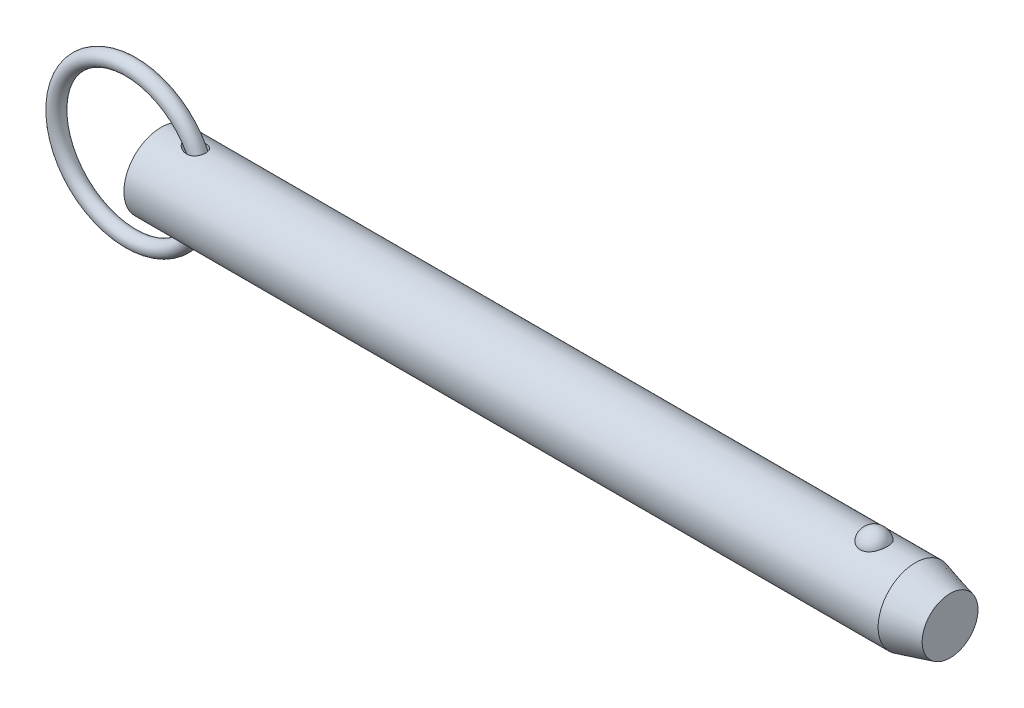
ISO-10303-21;
HEADER;
FILE_DESCRIPTION(('STEP AP214'),'2;1');
FILE_NAME('part.step','',(''),(''),'','','');
FILE_SCHEMA(('AUTOMOTIVE_DESIGN { 1 0 10303 214 1 1 1 1 }'));
ENDSEC;
DATA;
#1=APPLICATION_CONTEXT('core data for automotive mechanical design processes');
#2=APPLICATION_PROTOCOL_DEFINITION('international standard','automotive_design',2000,#1);
#3=PRODUCT_CONTEXT('',#1,'mechanical');
#4=PRODUCT('Part','Part','',(#3));
#5=PRODUCT_RELATED_PRODUCT_CATEGORY('part','',(#4));
#6=PRODUCT_DEFINITION_FORMATION('','',#4);
#7=PRODUCT_DEFINITION_CONTEXT('part definition',#1,'design');
#8=PRODUCT_DEFINITION('design','',#6,#7);
#9=PRODUCT_DEFINITION_SHAPE('','',#8);
#10=(LENGTH_UNIT() NAMED_UNIT(*) SI_UNIT(.MILLI.,.METRE.));
#11=(NAMED_UNIT(*) PLANE_ANGLE_UNIT() SI_UNIT($,.RADIAN.));
#12=(NAMED_UNIT(*) SI_UNIT($,.STERADIAN.) SOLID_ANGLE_UNIT());
#13=UNCERTAINTY_MEASURE_WITH_UNIT(LENGTH_MEASURE(1.E-05),#10,'distance_accuracy_value','');
#14=(GEOMETRIC_REPRESENTATION_CONTEXT(3) GLOBAL_UNCERTAINTY_ASSIGNED_CONTEXT((#13)) GLOBAL_UNIT_ASSIGNED_CONTEXT((#10,
#11,#12)) REPRESENTATION_CONTEXT('',''));
#15=CARTESIAN_POINT('',(0.,0.,0.));
#16=DIRECTION('',(0.,0.,1.));
#17=DIRECTION('',(1.,0.,0.));
#18=AXIS2_PLACEMENT_3D('',#15,#16,#17);
#19=CARTESIAN_POINT('',(-6.46799987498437,0.,0.));
#20=DIRECTION('',(0.,0.,1.));
#21=DIRECTION('',(1.,0.,0.));
#22=AXIS2_PLACEMENT_3D('',#19,#20,#21);
#23=TOROIDAL_SURFACE('',#22,15.875,1.588);
#24=CARTESIAN_POINT('',(10.9950001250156,0.,0.));
#25=VERTEX_POINT('',#24);
#26=VERTEX_LOOP('',#25);
#27=FACE_BOUND('',#26,.T.);
#28=ADVANCED_FACE('P0_F12',(#27),#23,.T.);
#29=CLOSED_SHELL('',(#28));
#30=MANIFOLD_SOLID_BREP('P0_B1',#29);
#31=CARTESIAN_POINT('',(0.,0.,0.));
#32=DIRECTION('',(1.,0.,0.));
#33=DIRECTION('',(0.,0.,-1.));
#34=AXIS2_PLACEMENT_3D('',#31,#32,#33);
#35=CYLINDRICAL_SURFACE('',#34,7.94);
#36=CARTESIAN_POINT('',(4.99454278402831,7.92831028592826,-0.430692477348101));
#37=CARTESIAN_POINT('',(5.02621962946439,7.92271974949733,-0.533554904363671));
#38=CARTESIAN_POINT('',(5.06869972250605,7.91528872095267,-0.633052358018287));
#39=CARTESIAN_POINT('',(5.17094751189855,7.89785690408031,-0.822566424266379));
#40=CARTESIAN_POINT('',(5.23077290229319,7.88784755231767,-0.912550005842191));
#41=CARTESIAN_POINT('',(5.37866013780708,7.8639674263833,-1.10117829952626));
#42=CARTESIAN_POINT('',(5.47004908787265,7.84973599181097,-1.19714712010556));
#43=CARTESIAN_POINT('',(5.66695490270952,7.82090787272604,-1.37293476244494));
#44=CARTESIAN_POINT('',(5.77247743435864,7.80631104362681,-1.45274707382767));
#45=CARTESIAN_POINT('',(5.99604254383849,7.77793596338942,-1.59776875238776));
#46=CARTESIAN_POINT('',(6.11428384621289,7.76417836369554,-1.66267404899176));
#47=CARTESIAN_POINT('',(6.35882685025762,7.73912410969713,-1.77564129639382));
#48=CARTESIAN_POINT('',(6.48513256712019,7.72782869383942,-1.82369477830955));
#49=CARTESIAN_POINT('',(6.76898453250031,7.70705630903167,-1.90977520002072));
#50=CARTESIAN_POINT('',(6.92778004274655,7.69837706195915,-1.94395681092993));
#51=CARTESIAN_POINT('',(7.24915504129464,7.6881294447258,-1.98412381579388));
#52=CARTESIAN_POINT('',(7.41173039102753,7.68655363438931,-1.99013871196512));
#53=CARTESIAN_POINT('',(7.697714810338,7.69094561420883,-1.97306069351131));
#54=CARTESIAN_POINT('',(7.82153338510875,7.69526202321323,-1.95634328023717));
#55=CARTESIAN_POINT('',(8.06460511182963,7.70859273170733,-1.90314615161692));
#56=CARTESIAN_POINT('',(8.18386164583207,7.7176034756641,-1.86668139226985));
#57=CARTESIAN_POINT('',(8.41450663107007,7.73959050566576,-1.77331230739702));
#58=CARTESIAN_POINT('',(8.52585042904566,7.75258738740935,-1.71630154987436));
#59=CARTESIAN_POINT('',(8.73575290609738,7.7809705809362,-1.58263416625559));
#60=CARTESIAN_POINT('',(8.83431445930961,7.7963563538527,-1.50598196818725));
#61=CARTESIAN_POINT('',(9.00639839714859,7.8259635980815,-1.34315626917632));
#62=CARTESIAN_POINT('',(9.08139772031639,7.84016008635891,-1.25853389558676));
#63=CARTESIAN_POINT('',(9.21545590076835,7.86710959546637,-1.07729126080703));
#64=CARTESIAN_POINT('',(9.27451869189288,7.87986297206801,-0.980673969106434));
#65=CARTESIAN_POINT('',(9.37315031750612,7.90198817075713,-0.782161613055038));
#66=CARTESIAN_POINT('',(9.41336512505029,7.91146854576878,-0.68059867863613));
#67=CARTESIAN_POINT('',(9.47650914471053,7.92664976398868,-0.471967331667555));
#68=CARTESIAN_POINT('',(9.49943917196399,7.93235078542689,-0.364899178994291));
#69=CARTESIAN_POINT('',(9.5274466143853,7.93934369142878,-0.14863226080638));
#70=CARTESIAN_POINT('',(9.53257574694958,7.9406483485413,-0.0394405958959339));
#71=CARTESIAN_POINT('',(9.52501411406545,7.93874464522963,0.178286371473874));
#72=CARTESIAN_POINT('',(9.51232314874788,7.93553623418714,0.286821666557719));
#73=CARTESIAN_POINT('',(9.46937875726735,7.92494527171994,0.500278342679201));
#74=CARTESIAN_POINT('',(9.43910562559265,7.9175580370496,0.605195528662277));
#75=CARTESIAN_POINT('',(9.36168926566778,7.8994090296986,0.808294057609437));
#76=CARTESIAN_POINT('',(9.3145467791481,7.88864740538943,0.906475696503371));
#77=CARTESIAN_POINT('',(9.20464679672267,7.86494645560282,1.09319438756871));
#78=CARTESIAN_POINT('',(9.14191093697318,7.85201015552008,1.18174456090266));
#79=CARTESIAN_POINT('',(9.00249124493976,7.82536913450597,1.34692675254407));
#80=CARTESIAN_POINT('',(8.92580850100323,7.81166447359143,1.42355969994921));
#81=CARTESIAN_POINT('',(8.76033130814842,7.78490157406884,1.56333296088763));
#82=CARTESIAN_POINT('',(8.67148512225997,7.77184644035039,1.62641250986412));
#83=CARTESIAN_POINT('',(8.48457694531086,7.74778101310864,1.73744892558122));
#84=CARTESIAN_POINT('',(8.38651410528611,7.73677090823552,1.78540439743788));
#85=CARTESIAN_POINT('',(8.18013312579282,7.71742695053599,1.86728938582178));
#86=CARTESIAN_POINT('',(8.07156725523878,7.7092102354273,1.90061897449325));
#87=CARTESIAN_POINT('',(7.85050876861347,7.6966502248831,1.95085652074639));
#88=CARTESIAN_POINT('',(7.73801453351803,7.69230854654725,1.967757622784));
#89=CARTESIAN_POINT('',(7.50002163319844,7.6873799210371,1.98693391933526));
#90=CARTESIAN_POINT('',(7.37438052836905,7.68722739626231,1.98751701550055));
#91=CARTESIAN_POINT('',(7.12435864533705,7.69142268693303,1.97121025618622));
#92=CARTESIAN_POINT('',(6.99997834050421,7.6957721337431,1.9543140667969));
#93=CARTESIAN_POINT('',(6.73521978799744,7.70925573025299,1.90049277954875));
#94=CARTESIAN_POINT('',(6.59543541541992,7.71903968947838,1.86081454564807));
#95=CARTESIAN_POINT('',(6.32319848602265,7.74233460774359,1.76138158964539));
#96=CARTESIAN_POINT('',(6.19076082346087,7.75585282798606,1.7015877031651));
#97=CARTESIAN_POINT('',(5.99269110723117,7.7785835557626,1.59336057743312));
#98=CARTESIAN_POINT('',(5.92332049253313,7.78707101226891,1.55151799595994));
#99=CARTESIAN_POINT('',(5.78862576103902,7.80440479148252,1.46183267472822));
#100=CARTESIAN_POINT('',(5.72330291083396,7.81325122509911,1.41398807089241));
#101=CARTESIAN_POINT('',(5.53492618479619,7.83980388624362,1.26162857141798));
#102=CARTESIAN_POINT('',(5.41884115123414,7.85759887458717,1.14795556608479));
#103=CARTESIAN_POINT('',(5.25731156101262,7.88350844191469,0.948390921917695));
#104=CARTESIAN_POINT('',(5.20241173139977,7.89260196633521,0.87019982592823));
#105=CARTESIAN_POINT('',(5.10541071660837,7.90897737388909,0.70602680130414));
#106=CARTESIAN_POINT('',(5.06329682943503,7.91626105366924,0.620052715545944));
#107=CARTESIAN_POINT('',(4.99458837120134,7.92827352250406,0.440665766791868));
#108=CARTESIAN_POINT('',(4.96816655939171,7.93297382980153,0.347182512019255));
#109=CARTESIAN_POINT('',(4.94275291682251,7.93751024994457,0.204498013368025));
#110=CARTESIAN_POINT('',(4.93665149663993,7.9386033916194,0.156529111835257));
#111=CARTESIAN_POINT('',(4.92932198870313,7.93991739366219,0.0602142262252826));
#112=CARTESIAN_POINT('',(4.92809242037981,7.94013851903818,0.011868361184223));
#113=CARTESIAN_POINT('',(4.93104052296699,7.93960920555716,-0.103241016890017));
#114=CARTESIAN_POINT('',(4.93747289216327,7.93845361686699,-0.169956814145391));
#115=CARTESIAN_POINT('',(4.95939910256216,7.93453812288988,-0.301777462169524));
#116=CARTESIAN_POINT('',(4.97489225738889,7.9317783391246,-0.36688243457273));
#117=CARTESIAN_POINT('',(4.99454278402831,7.92831028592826,-0.430692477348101));
#118=B_SPLINE_CURVE_WITH_KNOTS('',3,(#36,#37,#38,#39,#40,#41,#42,#43,#44,#45,#46,#47,#48,#49,
#50,#51,#52,#53,#54,#55,#56,#57,#58,#59,#60,#61,#62,#63,#64,#65,#66,#67,#68,#69,#70,#71,#72,#73,
#74,#75,#76,#77,#78,#79,#80,#81,#82,#83,#84,#85,#86,#87,#88,#89,#90,#91,#92,#93,#94,#95,#96,#97,
#98,#99,#100,#101,#102,#103,#104,#105,#106,#107,#108,#109,#110,#111,#112,#113,#114,#115,#116,
#117),.UNSPECIFIED.,.T.,.F.,(4,2,2,2,2,2,2,2,2,2,2,2,2,2,2,2,2,2,2,2,2,2,2,2,2,2,2,2,2,2,2,2,2,
2,2,2,2,2,2,2,4),(0.,0.323000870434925,0.647088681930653,1.04479679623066,1.4426648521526,
1.84804279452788,2.25362416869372,2.73917777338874,3.2242226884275,3.59772765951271,
3.97095014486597,4.34613445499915,4.72123425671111,5.06140749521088,5.40149668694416,
5.72887751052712,6.05624289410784,6.38265637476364,6.70907351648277,7.03585720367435,
7.36262652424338,7.68894495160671,8.01523792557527,8.34296459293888,8.67072147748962,
9.01089033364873,9.35120108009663,9.72668268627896,10.1023004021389,10.5375309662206,
10.9736138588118,11.2176803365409,11.461822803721,11.9480055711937,12.2349837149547,
12.5216758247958,12.8114683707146,12.9563497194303,13.1011870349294,13.3015737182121,
13.5019452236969),.UNSPECIFIED.);
#119=CARTESIAN_POINT('',(4.99454278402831,7.92831028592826,-0.430692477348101));
#120=VERTEX_POINT('',#119);
#121=EDGE_CURVE('P1_E40',#120,#120,#118,.T.);
#122=ORIENTED_EDGE('',*,*,#121,.T.);
#123=EDGE_LOOP('',(#122));
#124=FACE_BOUND('',#123,.T.);
#125=CARTESIAN_POINT('',(160.871879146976,0.,0.));
#126=DIRECTION('',(1.,0.,0.));
#127=DIRECTION('',(0.,0.,-1.));
#128=AXIS2_PLACEMENT_3D('',#125,#126,#127);
#129=CIRCLE('',#128,7.94);
#130=CARTESIAN_POINT('',(160.871879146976,0.,-7.94));
#131=VERTEX_POINT('',#130);
#132=EDGE_CURVE('P1_E25',#131,#131,#129,.T.);
#133=ORIENTED_EDGE('',*,*,#132,.F.);
#134=EDGE_LOOP('',(#133));
#135=FACE_BOUND('',#134,.T.);
#136=CARTESIAN_POINT('',(0.,0.,0.));
#137=DIRECTION('',(1.,0.,0.));
#138=DIRECTION('',(0.,0.,-1.));
#139=AXIS2_PLACEMENT_3D('',#136,#137,#138);
#140=CIRCLE('',#139,7.94);
#141=CARTESIAN_POINT('',(0.,0.,-7.94));
#142=VERTEX_POINT('',#141);
#143=EDGE_CURVE('P1_E9',#142,#142,#140,.T.);
#144=ORIENTED_EDGE('',*,*,#143,.T.);
#145=EDGE_LOOP('',(#144));
#146=FACE_BOUND('',#145,.T.);
#147=CARTESIAN_POINT('',(152.064907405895,7.37767842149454,2.93486986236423));
#148=CARTESIAN_POINT('',(151.912749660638,7.3776732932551,2.93487505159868));
#149=CARTESIAN_POINT('',(151.760632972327,7.38258419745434,2.92262454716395));
#150=CARTESIAN_POINT('',(151.460928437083,7.40163229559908,2.87404196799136));
#151=CARTESIAN_POINT('',(151.313339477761,7.41576720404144,2.83771585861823));
#152=CARTESIAN_POINT('',(151.027018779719,7.4516157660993,2.74218769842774));
#153=CARTESIAN_POINT('',(150.888274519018,7.47331841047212,2.68301886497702));
#154=CARTESIAN_POINT('',(150.622882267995,7.52194082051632,2.54350967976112));
#155=CARTESIAN_POINT('',(150.496236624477,7.54886159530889,2.46316523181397));
#156=CARTESIAN_POINT('',(150.254534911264,7.60594671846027,2.28090375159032));
#157=CARTESIAN_POINT('',(150.139906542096,7.63618114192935,2.1784421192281));
#158=CARTESIAN_POINT('',(149.928878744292,7.69614046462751,1.95608495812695));
#159=CARTESIAN_POINT('',(149.832482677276,7.72586526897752,1.83618622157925));
#160=CARTESIAN_POINT('',(149.655938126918,7.78314821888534,1.57628086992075));
#161=CARTESIAN_POINT('',(149.576707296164,7.81055035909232,1.43561546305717));
#162=CARTESIAN_POINT('',(149.441797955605,7.85879631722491,1.142363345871));
#163=CARTESIAN_POINT('',(149.386121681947,7.87963951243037,0.989775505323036));
#164=CARTESIAN_POINT('',(149.29881215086,7.91289645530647,0.674619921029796));
#165=CARTESIAN_POINT('',(149.26753090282,7.92518652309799,0.511941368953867));
#166=CARTESIAN_POINT('',(149.230975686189,7.93958930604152,0.183247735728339));
#167=CARTESIAN_POINT('',(149.225701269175,7.94170219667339,0.0172327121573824));
#168=CARTESIAN_POINT('',(149.241231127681,7.93554931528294,-0.312672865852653));
#169=CARTESIAN_POINT('',(149.261925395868,7.92732732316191,-0.476569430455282));
#170=CARTESIAN_POINT('',(149.32878655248,7.90141534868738,-0.798305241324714));
#171=CARTESIAN_POINT('',(149.374953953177,7.88372517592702,-0.95614436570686));
#172=CARTESIAN_POINT('',(149.491898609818,7.84066230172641,-1.26152073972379));
#173=CARTESIAN_POINT('',(149.562704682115,7.81528060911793,-1.40904568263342));
#174=CARTESIAN_POINT('',(149.727478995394,7.75948672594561,-1.68950598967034));
#175=CARTESIAN_POINT('',(149.821448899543,7.72907417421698,-1.82244030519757));
#176=CARTESIAN_POINT('',(150.030839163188,7.66640424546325,-2.07032792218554));
#177=CARTESIAN_POINT('',(150.146315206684,7.63414223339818,-2.18523308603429));
#178=CARTESIAN_POINT('',(150.3959006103,7.57149681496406,-2.39329737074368));
#179=CARTESIAN_POINT('',(150.530008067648,7.54111321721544,-2.48645870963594));
#180=CARTESIAN_POINT('',(150.810111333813,7.48650742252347,-2.64628132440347));
#181=CARTESIAN_POINT('',(150.955760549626,7.46215900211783,-2.71350554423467));
#182=CARTESIAN_POINT('',(151.257425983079,7.42171253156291,-2.82226614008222));
#183=CARTESIAN_POINT('',(151.413438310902,7.40561140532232,-2.86381209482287));
#184=CARTESIAN_POINT('',(151.722970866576,7.3842679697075,-2.9183907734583));
#185=CARTESIAN_POINT('',(151.876222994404,7.37852109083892,-2.93275024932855));
#186=CARTESIAN_POINT('',(152.183070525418,7.37700973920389,-2.93655208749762));
#187=CARTESIAN_POINT('',(152.336665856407,7.38124333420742,-2.92599927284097));
#188=CARTESIAN_POINT('',(152.634990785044,7.39890635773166,-2.88102897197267));
#189=CARTESIAN_POINT('',(152.779848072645,7.41205491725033,-2.84733999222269));
#190=CARTESIAN_POINT('',(153.06164329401,7.445801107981,-2.75788206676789));
#191=CARTESIAN_POINT('',(153.198580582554,7.46639934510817,-2.70211132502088));
#192=CARTESIAN_POINT('',(153.464061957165,7.51339098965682,-2.56858908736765));
#193=CARTESIAN_POINT('',(153.592354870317,7.53990200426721,-2.4903806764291));
#194=CARTESIAN_POINT('',(153.834244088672,7.59569503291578,-2.31462737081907));
#195=CARTESIAN_POINT('',(153.947837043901,7.6249776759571,-2.21707808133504));
#196=CARTESIAN_POINT('',(154.16322156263,7.68489473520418,-1.99982049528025));
#197=CARTESIAN_POINT('',(154.264148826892,7.71552419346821,-1.87925337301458));
#198=CARTESIAN_POINT('',(154.445186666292,7.77353016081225,-1.6226882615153));
#199=CARTESIAN_POINT('',(154.525293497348,7.80090608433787,-1.48668750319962));
#200=CARTESIAN_POINT('',(154.665361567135,7.85047992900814,-1.1981841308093));
#201=CARTESIAN_POINT('',(154.724587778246,7.87248183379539,-1.04529016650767));
#202=CARTESIAN_POINT('',(154.817982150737,7.90785114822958,-0.731080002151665));
#203=CARTESIAN_POINT('',(154.852149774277,7.92121837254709,-0.569763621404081));
#204=CARTESIAN_POINT('',(154.894795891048,7.93797834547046,-0.242812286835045));
#205=CARTESIAN_POINT('',(154.903204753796,7.94134405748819,-0.0771668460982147));
#206=CARTESIAN_POINT('',(154.893962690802,7.93767937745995,0.253276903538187));
#207=CARTESIAN_POINT('',(154.876312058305,7.93064910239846,0.418075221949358));
#208=CARTESIAN_POINT('',(154.815424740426,7.90695571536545,0.741525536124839));
#209=CARTESIAN_POINT('',(154.772281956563,7.8903279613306,0.900197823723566));
#210=CARTESIAN_POINT('',(154.66135358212,7.84916386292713,1.20759654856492));
#211=CARTESIAN_POINT('',(154.59356656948,7.82462706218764,1.35632241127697));
#212=CARTESIAN_POINT('',(154.434371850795,7.77006699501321,1.64032869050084));
#213=CARTESIAN_POINT('',(154.342861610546,7.74002008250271,1.7755471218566));
#214=CARTESIAN_POINT('',(154.138296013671,7.67774175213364,2.0280064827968));
#215=CARTESIAN_POINT('',(154.025241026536,7.64551037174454,2.14524772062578));
#216=CARTESIAN_POINT('',(153.780831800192,7.58265895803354,2.35778002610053));
#217=CARTESIAN_POINT('',(153.649583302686,7.5520309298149,2.45319004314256));
#218=CARTESIAN_POINT('',(153.371601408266,7.49579792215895,2.61999897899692));
#219=CARTESIAN_POINT('',(153.224867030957,7.47019326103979,2.69139637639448));
#220=CARTESIAN_POINT('',(152.912947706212,7.42622216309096,2.8105324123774));
#221=CARTESIAN_POINT('',(152.747220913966,7.40825002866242,2.85700910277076));
#222=CARTESIAN_POINT('',(152.409279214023,7.38398348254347,2.9191685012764));
#223=CARTESIAN_POINT('',(152.23706702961,7.3776842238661,2.93486399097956));
#224=CARTESIAN_POINT('',(152.064907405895,7.37767842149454,2.93486986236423));
#225=B_SPLINE_CURVE_WITH_KNOTS('',3,(#147,#148,#149,#150,#151,#152,#153,#154,#155,#156,#157,
#158,#159,#160,#161,#162,#163,#164,#165,#166,#167,#168,#169,#170,#171,#172,#173,#174,#175,#176,
#177,#178,#179,#180,#181,#182,#183,#184,#185,#186,#187,#188,#189,#190,#191,#192,#193,#194,#195,
#196,#197,#198,#199,#200,#201,#202,#203,#204,#205,#206,#207,#208,#209,#210,#211,#212,#213,#214,
#215,#216,#217,#218,#219,#220,#221,#222,#223,#224),.UNSPECIFIED.,.T.,.F.,(4,2,2,2,2,2,2,2,2,2,2,
2,2,2,2,2,2,2,2,2,2,2,2,2,2,2,2,2,2,2,2,2,2,2,2,2,2,2,4),(0.,0.455841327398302,
0.911569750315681,1.36663794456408,1.82179423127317,2.2897898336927,2.75787163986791,
3.24685368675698,3.73588214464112,4.23184282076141,4.72779494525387,5.22165321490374,
5.71552141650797,6.20996917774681,6.7044524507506,7.20023431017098,7.69596557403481,
8.18023418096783,8.66432203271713,9.12410697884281,9.58380291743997,10.0296503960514,
10.4755341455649,10.9312349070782,11.3870393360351,11.8654416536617,12.3439299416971,
12.8378875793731,13.3318558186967,13.8271581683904,14.3224549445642,14.8159385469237,
15.3094506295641,15.8051323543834,16.3008055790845,16.7937101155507,17.2866458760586,
17.8026240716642,18.3183879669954),.UNSPECIFIED.);
#226=CARTESIAN_POINT('',(152.064907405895,7.37767842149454,2.93486986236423));
#227=VERTEX_POINT('',#226);
#228=EDGE_CURVE('P1_E34',#227,#227,#225,.T.);
#229=ORIENTED_EDGE('',*,*,#228,.T.);
#230=EDGE_LOOP('',(#229));
#231=FACE_BOUND('',#230,.T.);
#232=CARTESIAN_POINT('',(4.99454278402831,-7.92831028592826,-0.430692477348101));
#233=CARTESIAN_POINT('',(4.97033227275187,-7.93258231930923,-0.352006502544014));
#234=CARTESIAN_POINT('',(4.95238785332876,-7.93578782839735,-0.271213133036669));
#235=CARTESIAN_POINT('',(4.93055628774,-7.93969351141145,-0.107590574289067));
#236=CARTESIAN_POINT('',(4.92668686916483,-7.9403905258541,-0.0247589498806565));
#237=CARTESIAN_POINT('',(4.9333808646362,-7.93918950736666,0.140249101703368));
#238=CARTESIAN_POINT('',(4.94393526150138,-7.93729309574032,0.222425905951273));
#239=CARTESIAN_POINT('',(4.97854187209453,-7.93113325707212,0.383746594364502));
#240=CARTESIAN_POINT('',(5.00259804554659,-7.92686913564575,0.462889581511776));
#241=CARTESIAN_POINT('',(5.06904511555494,-7.91526143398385,0.633278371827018));
#242=CARTESIAN_POINT('',(5.11430124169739,-7.90744739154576,0.723368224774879));
#243=CARTESIAN_POINT('',(5.21873327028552,-7.88988375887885,0.894880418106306));
#244=CARTESIAN_POINT('',(5.27793532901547,-7.88013053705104,0.976286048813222));
#245=CARTESIAN_POINT('',(5.42949971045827,-7.85602233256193,1.15646341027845));
#246=CARTESIAN_POINT('',(5.52624420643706,-7.84124381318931,1.25147911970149));
#247=CARTESIAN_POINT('',(5.73364751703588,-7.81163164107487,1.42469165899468));
#248=CARTESIAN_POINT('',(5.84432059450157,-7.79679794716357,1.50287102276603));
#249=CARTESIAN_POINT('',(6.07871104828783,-7.76824211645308,1.64418004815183));
#250=CARTESIAN_POINT('',(6.20267992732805,-7.75455572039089,1.70689813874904));
#251=CARTESIAN_POINT('',(6.45850163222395,-7.73013259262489,1.81429879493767));
#252=CARTESIAN_POINT('',(6.59035778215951,-7.71939711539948,1.85897369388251));
#253=CARTESIAN_POINT('',(6.88209177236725,-7.70072462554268,1.93500734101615));
#254=CARTESIAN_POINT('',(7.04295460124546,-7.69356120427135,1.96286607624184));
#255=CARTESIAN_POINT('',(7.36724421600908,-7.68676336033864,1.98935053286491));
#256=CARTESIAN_POINT('',(7.53066723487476,-7.68711875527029,1.98801578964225));
#257=CARTESIAN_POINT('',(7.81370255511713,-7.69496475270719,1.95735673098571));
#258=CARTESIAN_POINT('',(7.93413357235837,-7.70066491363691,1.93505220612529));
#259=CARTESIAN_POINT('',(8.16950597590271,-7.71642704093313,1.87121573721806));
#260=CARTESIAN_POINT('',(8.28445128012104,-7.72648584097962,1.82969774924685));
#261=CARTESIAN_POINT('',(8.50557964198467,-7.75006886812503,1.72707806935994));
#262=CARTESIAN_POINT('',(8.61171927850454,-7.76360905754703,1.66588583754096));
#263=CARTESIAN_POINT('',(8.810712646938,-7.79249659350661,1.52503518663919));
#264=CARTESIAN_POINT('',(8.90356827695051,-7.80784368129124,1.44537941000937));
#265=CARTESIAN_POINT('',(9.06550151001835,-7.83702302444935,1.27723027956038));
#266=CARTESIAN_POINT('',(9.1359139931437,-7.85087516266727,1.19002179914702));
#267=CARTESIAN_POINT('',(9.26060432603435,-7.87675706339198,1.00451336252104));
#268=CARTESIAN_POINT('',(9.31488561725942,-7.88878721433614,0.906215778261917));
#269=CARTESIAN_POINT('',(9.40446618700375,-7.90930761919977,0.70456335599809));
#270=CARTESIAN_POINT('',(9.44028687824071,-7.91789338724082,0.601449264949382));
#271=CARTESIAN_POINT('',(9.49451523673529,-7.93109531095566,0.390496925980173));
#272=CARTESIAN_POINT('',(9.51292345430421,-7.93571159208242,0.282658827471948));
#273=CARTESIAN_POINT('',(9.53189686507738,-7.94047189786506,0.0654759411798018));
#274=CARTESIAN_POINT('',(9.53248611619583,-7.94062195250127,-0.0438666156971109));
#275=CARTESIAN_POINT('',(9.51587068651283,-7.93644929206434,-0.26110665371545));
#276=CARTESIAN_POINT('',(9.49866585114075,-7.93212653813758,-0.369004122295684));
#277=CARTESIAN_POINT('',(9.44682594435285,-7.91946859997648,-0.58038072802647));
#278=CARTESIAN_POINT('',(9.412176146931,-7.91113002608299,-0.683856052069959));
#279=CARTESIAN_POINT('',(9.32626198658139,-7.89134774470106,-0.883337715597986));
#280=CARTESIAN_POINT('',(9.27499851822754,-7.87990420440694,-0.979344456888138));
#281=CARTESIAN_POINT('',(9.15725058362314,-7.8551872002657,-1.1610523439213));
#282=CARTESIAN_POINT('',(9.09078836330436,-7.84191642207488,-1.24676827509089));
#283=CARTESIAN_POINT('',(8.94443523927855,-7.81498501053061,-1.40574704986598));
#284=CARTESIAN_POINT('',(8.86454527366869,-7.80132440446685,-1.47901076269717));
#285=CARTESIAN_POINT('',(8.69307774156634,-7.77497848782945,-1.61181253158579));
#286=CARTESIAN_POINT('',(8.60142539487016,-7.76230033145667,-1.67125525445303));
#287=CARTESIAN_POINT('',(8.40957687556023,-7.73928987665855,-1.77477159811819));
#288=CARTESIAN_POINT('',(8.30937953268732,-7.72895790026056,-1.81884310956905));
#289=CARTESIAN_POINT('',(8.0986350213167,-7.71113842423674,-1.89300673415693));
#290=CARTESIAN_POINT('',(7.98782526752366,-7.70379913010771,-1.92238394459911));
#291=CARTESIAN_POINT('',(7.76294389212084,-7.69313871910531,-1.96460780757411));
#292=CARTESIAN_POINT('',(7.64887102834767,-7.68981915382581,-1.9774480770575));
#293=CARTESIAN_POINT('',(7.40716929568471,-7.68706358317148,-1.98813881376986));
#294=CARTESIAN_POINT('',(7.27945620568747,-7.68810537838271,-1.98414471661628));
#295=CARTESIAN_POINT('',(7.02593945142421,-7.6946815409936,-1.95847707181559));
#296=CARTESIAN_POINT('',(6.90013720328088,-7.7002190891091,-1.93679100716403));
#297=CARTESIAN_POINT('',(6.63265145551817,-7.71617635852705,-1.87230070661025));
#298=CARTESIAN_POINT('',(6.49169161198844,-7.72724102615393,-1.82664736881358));
#299=CARTESIAN_POINT('',(6.21840602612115,-7.75282261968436,-1.71482542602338));
#300=CARTESIAN_POINT('',(6.08608498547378,-7.76734140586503,-1.64864576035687));
#301=CARTESIAN_POINT('',(5.84453114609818,-7.7967744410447,-1.50297952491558));
#302=CARTESIAN_POINT('',(5.73429128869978,-7.81154606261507,-1.4251373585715));
#303=CARTESIAN_POINT('',(5.52761180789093,-7.84104229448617,-1.25271210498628));
#304=CARTESIAN_POINT('',(5.43116004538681,-7.85576693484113,-1.15814390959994));
#305=CARTESIAN_POINT('',(5.27970568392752,-7.87984260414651,-0.978603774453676));
#306=CARTESIAN_POINT('',(5.22040249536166,-7.88960721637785,-0.897319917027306));
#307=CARTESIAN_POINT('',(5.11583115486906,-7.90718602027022,-0.726171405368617));
#308=CARTESIAN_POINT('',(5.07050564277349,-7.9150081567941,-0.636343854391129));
#309=CARTESIAN_POINT('',(5.01937588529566,-7.92393751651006,-0.506165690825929));
#310=CARTESIAN_POINT('',(5.00622932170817,-7.926248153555,-0.468674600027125));
#311=CARTESIAN_POINT('',(4.99454278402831,-7.92831028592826,-0.430692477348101));
#312=B_SPLINE_CURVE_WITH_KNOTS('',3,(#232,#233,#234,#235,#236,#237,#238,#239,#240,#241,#242,
#243,#244,#245,#246,#247,#248,#249,#250,#251,#252,#253,#254,#255,#256,#257,#258,#259,#260,#261,
#262,#263,#264,#265,#266,#267,#268,#269,#270,#271,#272,#273,#274,#275,#276,#277,#278,#279,#280,
#281,#282,#283,#284,#285,#286,#287,#288,#289,#290,#291,#292,#293,#294,#295,#296,#297,#298,#299,
#300,#301,#302,#303,#304,#305,#306,#307,#308,#309,#310,#311),.UNSPECIFIED.,.T.,.F.,(4,2,2,2,2,2,
2,2,2,2,2,2,2,2,2,2,2,2,2,2,2,2,2,2,2,2,2,2,2,2,2,2,2,2,2,2,2,2,2,4),(0.,0.247186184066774,
0.494683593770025,0.742026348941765,0.989441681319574,1.29115800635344,1.59344478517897,
2.00047108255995,2.40791761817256,2.82525860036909,3.2427767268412,3.7304673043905,
4.21749746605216,4.58380730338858,4.94985148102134,5.31760488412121,5.68530568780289,
6.02244390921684,6.35951015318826,6.68644714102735,7.01337379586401,7.33985903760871,
7.66634711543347,7.9931112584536,8.31985780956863,8.64612913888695,8.97237768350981,
9.30081392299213,9.62929521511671,9.9724956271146,10.3158284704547,10.6977037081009,
11.0798493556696,11.523823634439,11.9680375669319,12.3738595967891,12.7793221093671,
13.0815405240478,13.3825016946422,13.5018197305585),.UNSPECIFIED.);
#313=CARTESIAN_POINT('',(4.99454278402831,-7.92831028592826,-0.430692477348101));
#314=VERTEX_POINT('',#313);
#315=EDGE_CURVE('P1_E17',#314,#314,#312,.T.);
#316=ORIENTED_EDGE('',*,*,#315,.T.);
#317=EDGE_LOOP('',(#316));
#318=FACE_BOUND('',#317,.T.);
#319=ADVANCED_FACE('P1_F13',(#124,#135,#146,#231,#318),#35,.T.);
#320=CARTESIAN_POINT('',(0.,0.,0.));
#321=DIRECTION('',(-1.,0.,0.));
#322=DIRECTION('',(0.,0.,1.));
#323=AXIS2_PLACEMENT_3D('',#320,#321,#322);
#324=PLANE('',#323);
#325=ORIENTED_EDGE('',*,*,#143,.F.);
#326=EDGE_LOOP('',(#325));
#327=FACE_BOUND('',#326,.T.);
#328=ADVANCED_FACE('P1_F15',(#327),#324,.T.);
#329=CARTESIAN_POINT('',(168.28,0.,0.));
#330=DIRECTION('',(-1.,0.,0.));
#331=DIRECTION('',(0.,0.,1.));
#332=AXIS2_PLACEMENT_3D('',#329,#330,#331);
#333=CONICAL_SURFACE('',#332,5.95500000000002,0.261799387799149);
#334=ORIENTED_EDGE('',*,*,#132,.T.);
#335=EDGE_LOOP('',(#334));
#336=FACE_BOUND('',#335,.T.);
#337=CARTESIAN_POINT('',(168.28,0.,0.));
#338=DIRECTION('',(1.,0.,0.));
#339=DIRECTION('',(0.,0.,-1.));
#340=AXIS2_PLACEMENT_3D('',#337,#338,#339);
#341=CIRCLE('',#340,5.95500000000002);
#342=CARTESIAN_POINT('',(168.28,0.,-5.95500000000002));
#343=VERTEX_POINT('',#342);
#344=EDGE_CURVE('P1_E30',#343,#343,#341,.T.);
#345=ORIENTED_EDGE('',*,*,#344,.F.);
#346=EDGE_LOOP('',(#345));
#347=FACE_BOUND('',#346,.T.);
#348=ADVANCED_FACE('P1_F55',(#336,#347),#333,.T.);
#349=CARTESIAN_POINT('',(168.28,5.95500000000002,0.));
#350=DIRECTION('',(1.,0.,0.));
#351=DIRECTION('',(0.,0.,-1.));
#352=AXIS2_PLACEMENT_3D('',#349,#350,#351);
#353=PLANE('',#352);
#354=ORIENTED_EDGE('',*,*,#344,.T.);
#355=EDGE_LOOP('',(#354));
#356=FACE_BOUND('',#355,.T.);
#357=ADVANCED_FACE('P1_F51',(#356),#353,.T.);
#358=CARTESIAN_POINT('',(152.064907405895,7.146,0.));
#359=DIRECTION('',(-1.,0.,0.));
#360=DIRECTION('',(0.,1.,0.));
#361=AXIS2_PLACEMENT_3D('',#358,#359,#360);
#362=SPHERICAL_SURFACE('',#361,2.944);
#363=ORIENTED_EDGE('',*,*,#228,.F.);
#364=EDGE_LOOP('',(#363));
#365=FACE_BOUND('',#364,.T.);
#366=ADVANCED_FACE('P1_F46',(#365),#362,.T.);
#367=CARTESIAN_POINT('',(-6.46799987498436,0.,0.));
#368=DIRECTION('',(0.,0.,1.));
#369=DIRECTION('',(1.,0.,0.));
#370=AXIS2_PLACEMENT_3D('',#367,#368,#369);
#371=TOROIDAL_SURFACE('',#370,15.875,1.985);
#372=ORIENTED_EDGE('',*,*,#315,.F.);
#373=EDGE_LOOP('',(#372));
#374=FACE_BOUND('',#373,.T.);
#375=ORIENTED_EDGE('',*,*,#121,.F.);
#376=EDGE_LOOP('',(#375));
#377=FACE_BOUND('',#376,.T.);
#378=ADVANCED_FACE('P1_F50',(#374,#377),#371,.F.);
#379=CLOSED_SHELL('',(#319,#328,#348,#357,#366,#378));
#380=MANIFOLD_SOLID_BREP('P1_B1',#379);
#381=ADVANCED_BREP_SHAPE_REPRESENTATION('',(#18,#30,#380),#14);
#382=SHAPE_DEFINITION_REPRESENTATION(#9,#381);
ENDSEC;
END-ISO-10303-21;
